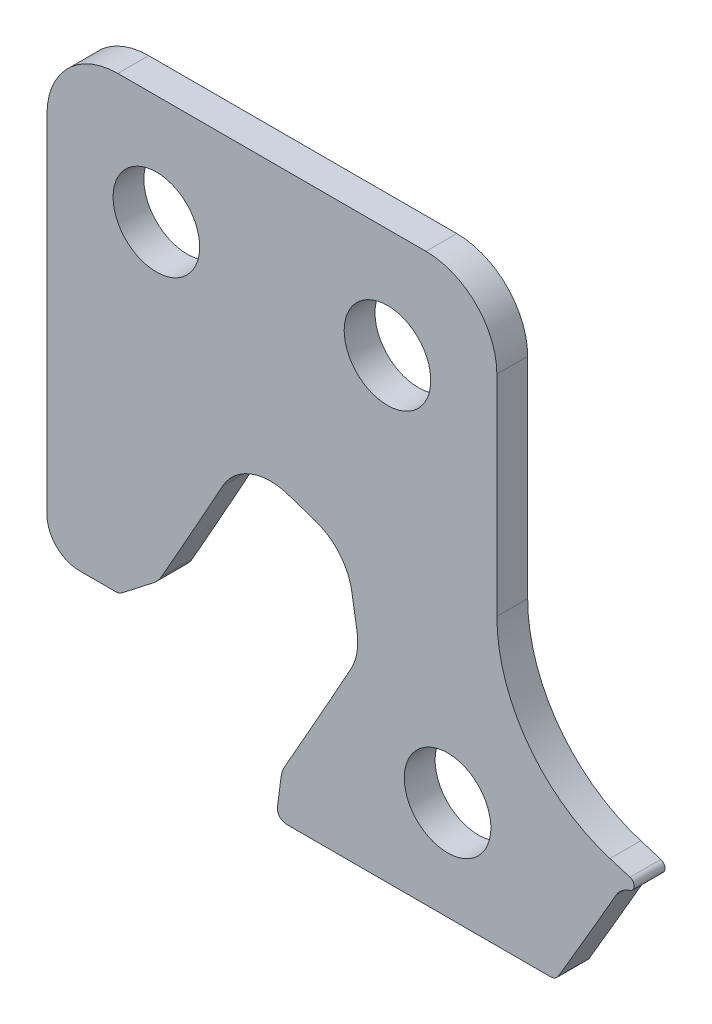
from build123d import *

# Parameters (mm, degrees)
BOSS_EXTRUDE1_DEPTH = 2.54
HOLE1_D             = 7.1374


with BuildPart() as part:
    # Sketch1 → Boss-Extrude1 (new body)
    with BuildSketch(Plane.XY):
        with BuildLine():
            Line((-959.304602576, 67.745339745), (-960.955669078, 68.253271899))
            ThreePointArc((-960.955669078, 68.253271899), (-967.696188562, 73.030233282), (-970.28, 80.877390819))
            Line((-970.28, 80.877390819), (-970.28, 98.171))
            ThreePointArc((-970.28, 98.171), (-971.991082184, 102.301917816), (-976.122, 104.013))
            Line((-976.122, 104.013), (-1001.522, 104.013))
            ThreePointArc((-1001.522, 104.013), (-1005.652917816, 102.301917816), (-1007.364, 98.171))
            Line((-1007.364, 98.171), (-1007.364, 69.596))
            ThreePointArc((-1007.364, 69.596), (-1006.582853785, 67.710146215), (-1004.697, 66.929))
            Line((-1004.697, 66.929), (-1001.662584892, 66.929))
            ThreePointArc((-1001.662584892, 66.929), (-1001.414724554, 66.970438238), (-1001.193821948, 67.090246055))
            Line((-1001.193821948, 67.090246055), (-998.567958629, 69.139183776))
            ThreePointArc((-998.567958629, 69.139183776), (-998.208151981, 69.481524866), (-997.921840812, 69.887337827))
            ThreePointArc((-997.921840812, 69.887337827), (-995.392292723, 74.373082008), (-992.89010255, 78.874143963))
            ThreePointArc((-992.89010255, 78.874143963), (-990.586061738, 80.893841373), (-987.523168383, 80.974252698))
            Line((-987.523168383, 80.974252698), (-985.266924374, 80.225320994))
            ThreePointArc((-985.266924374, 80.225320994), (-983.258603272, 78.873889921), (-982.238865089, 76.678473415))
            Line((-982.238865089, 76.678473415), (-981.803276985, 74.030050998))
            ThreePointArc((-981.803276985, 74.030050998), (-981.809752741, 72.528500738), (-982.309033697, 71.112374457))
            ThreePointArc((-982.309033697, 71.112374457), (-985.017857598, 66.264160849), (-987.757975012, 61.43356475))
            ThreePointArc((-987.757975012, 61.43356475), (-987.960503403, 60.982050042), (-988.071639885, 60.49983436))
            Line((-988.071639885, 60.49983436), (-988.367071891, 58.221447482))
            ThreePointArc((-988.367071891, 58.221447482), (-988.183809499, 57.620480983), (-987.611398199, 57.361461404))
            Line((-987.611398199, 57.361461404), (-965.862080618, 57.361461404))
            ThreePointArc((-965.862080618, 57.361461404), (-965.484220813, 57.461746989), (-965.205820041, 57.736206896))
            ThreePointArc((-965.205820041, 57.736206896), (-962.822854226, 61.800315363), (-960.462561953, 65.877633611))
            ThreePointArc((-960.462561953, 65.877633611), (-959.970741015, 66.451061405), (-959.303437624, 66.805199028))
            ThreePointArc((-959.303437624, 66.805199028), (-958.957270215, 67.275699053), (-959.304602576, 67.745339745))
        make_face()
    extrude(amount=-BOSS_EXTRUDE1_DEPTH)

    # Hole1 (through all)
    with Locations(Plane(origin=(-970.689739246, 76.133140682, -2.54), x_dir=(-1, 0, 0), z_dir=(0, 0, -1))):
        with Locations((3.654260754, -10.601140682), (8.607260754, 18.862859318), (27.657260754, 18.862859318)):
            Hole(HOLE1_D / 2)


solid = part.part
